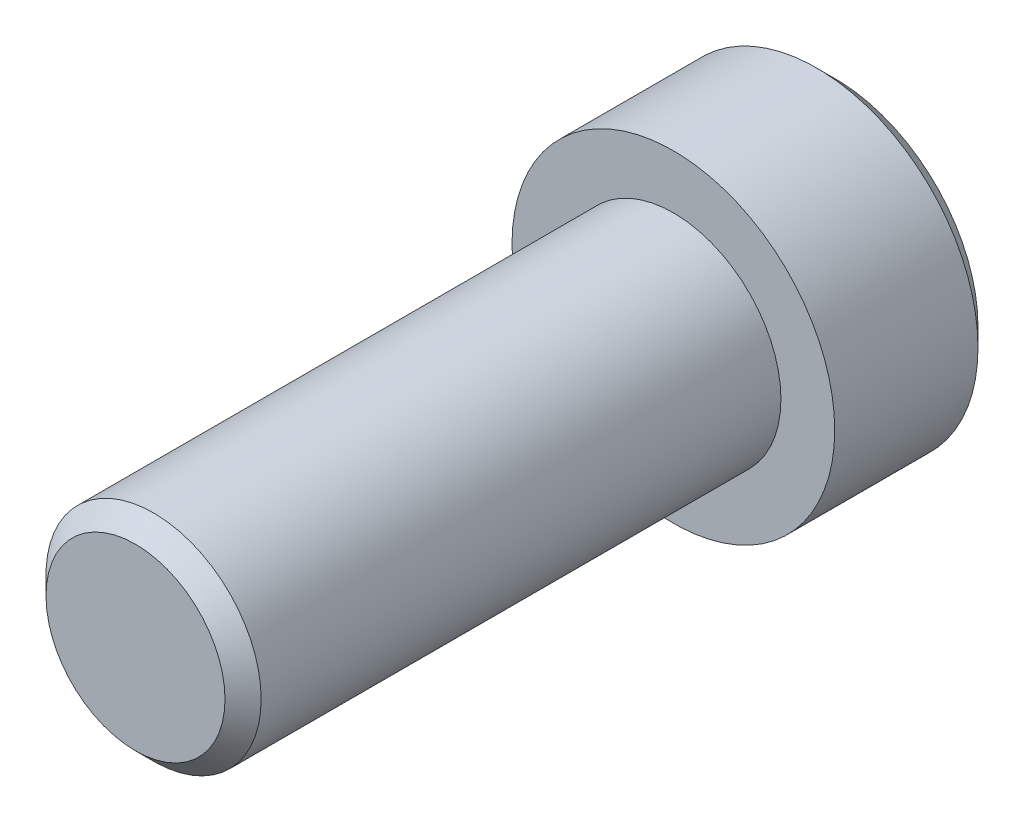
from build123d import *

# Parameters (mm, degrees)
CUT_EXTRUDE1_DEPTH = 4.699
CHAMFER2_SIZE      = 0.5334
CHAMFER3_SIZE      = 0.5334


with BuildPart() as part:
    # Sketch1 → Revolve1 (revolve)
    with BuildSketch(Plane(origin=(0, 0, 0), x_dir=(1, 0, 0), z_dir=(0, 1, 0))):
        Polygon((0, -15.875), (3.175, -15.875), (3.175, 0), (4.7625, 0), (4.7625, 4.7625), (0, 4.7625), (0, 0), align=None)
    revolve(axis=Axis((0, 0, 15.875), (0, 0, -1)))

    # Sketch2 → Cut-Extrude1 (cut)
    with BuildSketch(Plane(origin=(0, 0, -4.7625), x_dir=(-1, 0, 0), z_dir=(0, 0, -1))):
        Polygon((-2.386901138, -1.36498048), (-0.011342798, -2.749607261), (2.37555834, -1.384626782), (2.386901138, 1.36498048), (0.011342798, 2.749607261), (-2.37555834, 1.384626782), align=None)
    extrude(amount=-CUT_EXTRUDE1_DEPTH, mode=Mode.SUBTRACT)

    # Chamfer2
    chamfer2_edges = [part.edges().sort_by_distance(p)[0] for p in [
        (-4.7625, 0, -4.7625),
    ]]
    chamfer(chamfer2_edges, length=CHAMFER2_SIZE)

    # Chamfer3
    chamfer3_edges = [part.edges().sort_by_distance(p)[0] for p in [
        (-3.175, 0, 15.875),
    ]]
    chamfer(chamfer3_edges, length=CHAMFER3_SIZE)


solid = part.part
